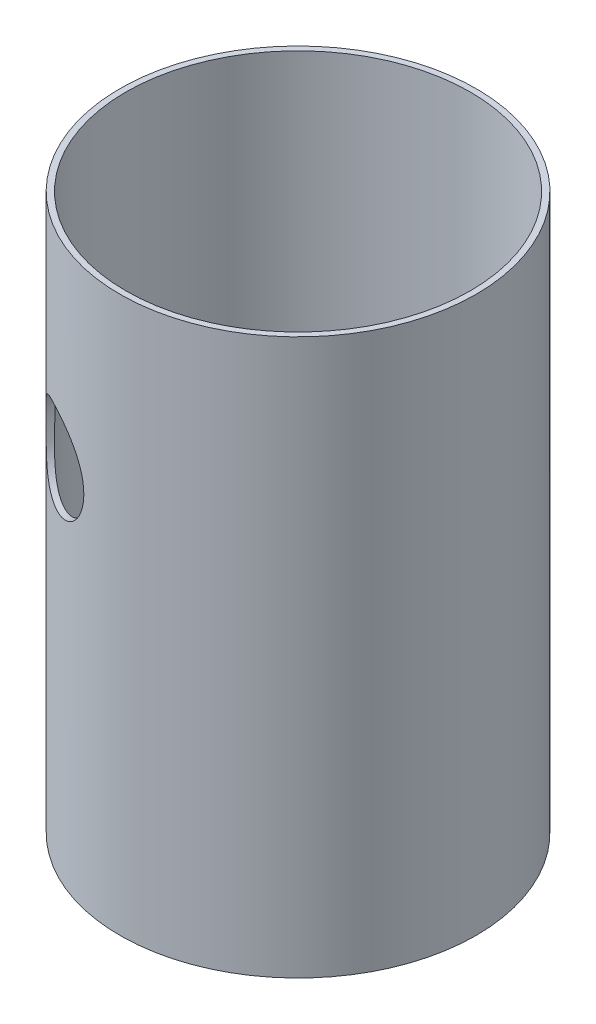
ISO-10303-21;
HEADER;
FILE_DESCRIPTION(('STEP AP214'),'2;1');
FILE_NAME('part.step','',(''),(''),'','','');
FILE_SCHEMA(('AUTOMOTIVE_DESIGN { 1 0 10303 214 1 1 1 1 }'));
ENDSEC;
DATA;
#1=APPLICATION_CONTEXT('core data for automotive mechanical design processes');
#2=APPLICATION_PROTOCOL_DEFINITION('international standard','automotive_design',2000,#1);
#3=PRODUCT_CONTEXT('',#1,'mechanical');
#4=PRODUCT('Part','Part','',(#3));
#5=PRODUCT_RELATED_PRODUCT_CATEGORY('part','',(#4));
#6=PRODUCT_DEFINITION_FORMATION('','',#4);
#7=PRODUCT_DEFINITION_CONTEXT('part definition',#1,'design');
#8=PRODUCT_DEFINITION('design','',#6,#7);
#9=PRODUCT_DEFINITION_SHAPE('','',#8);
#10=(LENGTH_UNIT() NAMED_UNIT(*) SI_UNIT(.MILLI.,.METRE.));
#11=(NAMED_UNIT(*) PLANE_ANGLE_UNIT() SI_UNIT($,.RADIAN.));
#12=(NAMED_UNIT(*) SI_UNIT($,.STERADIAN.) SOLID_ANGLE_UNIT());
#13=UNCERTAINTY_MEASURE_WITH_UNIT(LENGTH_MEASURE(1.E-05),#10,'distance_accuracy_value','');
#14=(GEOMETRIC_REPRESENTATION_CONTEXT(3) GLOBAL_UNCERTAINTY_ASSIGNED_CONTEXT((#13)) GLOBAL_UNIT_ASSIGNED_CONTEXT((#10,
#11,#12)) REPRESENTATION_CONTEXT('',''));
#15=CARTESIAN_POINT('',(0.,0.,0.));
#16=DIRECTION('',(0.,0.,1.));
#17=DIRECTION('',(1.,0.,0.));
#18=AXIS2_PLACEMENT_3D('',#15,#16,#17);
#19=CARTESIAN_POINT('',(100.573445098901,-427.,-330.861402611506));
#20=DIRECTION('',(0.,1.,0.));
#21=DIRECTION('',(0.,0.,1.));
#22=AXIS2_PLACEMENT_3D('',#19,#20,#21);
#23=CYLINDRICAL_SURFACE('',#22,211.703590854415);
#24=CARTESIAN_POINT('',(52.,0.,-124.805510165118));
#25=CARTESIAN_POINT('',(52.0000001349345,1.42356525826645,-124.805510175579));
#26=CARTESIAN_POINT('',(51.9415021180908,2.84712847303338,-124.819273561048));
#27=CARTESIAN_POINT('',(51.7079927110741,5.68412123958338,-124.87452853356));
#28=CARTESIAN_POINT('',(51.5329817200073,7.09755082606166,-124.916020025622));
#29=CARTESIAN_POINT('',(51.0678979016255,9.90419910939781,-125.027323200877));
#30=CARTESIAN_POINT('',(50.7778267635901,11.2974181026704,-125.097134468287));
#31=CARTESIAN_POINT('',(50.0850416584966,14.0537509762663,-125.266027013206));
#32=CARTESIAN_POINT('',(49.6823276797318,15.4168648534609,-125.365108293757));
#33=CARTESIAN_POINT('',(48.7676602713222,18.1032764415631,-125.59378932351));
#34=CARTESIAN_POINT('',(48.2557085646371,19.4265747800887,-125.723388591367));
#35=CARTESIAN_POINT('',(47.1269379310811,22.0240072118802,-126.014579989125));
#36=CARTESIAN_POINT('',(46.5101191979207,23.298141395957,-126.176172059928));
#37=CARTESIAN_POINT('',(45.1769982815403,25.7882364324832,-126.532941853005));
#38=CARTESIAN_POINT('',(44.4607019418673,27.0042006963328,-126.728117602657));
#39=CARTESIAN_POINT('',(42.9348866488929,29.3696504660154,-127.153685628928));
#40=CARTESIAN_POINT('',(42.1253676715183,30.5191359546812,-127.384077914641));
#41=CARTESIAN_POINT('',(40.419140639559,32.7454208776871,-127.881944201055));
#42=CARTESIAN_POINT('',(39.5223170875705,33.8221207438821,-128.149467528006));
#43=CARTESIAN_POINT('',(37.650413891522,35.8942302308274,-128.722686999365));
#44=CARTESIAN_POINT('',(36.6753344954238,36.8896401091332,-129.028383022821));
#45=CARTESIAN_POINT('',(34.655647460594,38.7931915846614,-129.678949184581));
#46=CARTESIAN_POINT('',(33.6110421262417,39.7013360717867,-130.023818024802));
#47=CARTESIAN_POINT('',(31.4614853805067,41.4255162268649,-130.753343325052));
#48=CARTESIAN_POINT('',(30.3565331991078,42.241550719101,-131.138000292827));
#49=CARTESIAN_POINT('',(28.0759814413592,43.7912442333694,-131.95433825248));
#50=CARTESIAN_POINT('',(26.8994824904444,44.523206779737,-132.386725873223));
#51=CARTESIAN_POINT('',(24.5040588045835,45.8851774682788,-133.292431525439));
#52=CARTESIAN_POINT('',(23.2851337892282,46.5151849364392,-133.765749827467));
#53=CARTESIAN_POINT('',(20.8147432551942,47.6718674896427,-134.752430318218));
#54=CARTESIAN_POINT('',(19.563273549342,48.1985292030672,-135.265797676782));
#55=CARTESIAN_POINT('',(17.0376327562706,49.1481382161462,-136.331052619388));
#56=CARTESIAN_POINT('',(15.7634609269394,49.5710821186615,-136.882941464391));
#57=CARTESIAN_POINT('',(13.1273009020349,50.3355235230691,-138.05636577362));
#58=CARTESIAN_POINT('',(11.7645036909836,50.6708786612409,-138.680084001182));
#59=CARTESIAN_POINT('',(9.03380840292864,51.2282391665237,-139.965663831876));
#60=CARTESIAN_POINT('',(7.66591016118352,51.450240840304,-140.627526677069));
#61=CARTESIAN_POINT('',(4.93374873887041,51.7837099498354,-141.986345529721));
#62=CARTESIAN_POINT('',(3.56948651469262,51.8951507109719,-142.683309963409));
#63=CARTESIAN_POINT('',(0.852943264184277,52.010778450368,-144.10866404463));
#64=CARTESIAN_POINT('',(-0.49933721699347,52.014960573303,-144.837055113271));
#65=CARTESIAN_POINT('',(-3.33337024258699,51.9144981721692,-146.403585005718));
#66=CARTESIAN_POINT('',(-4.81291260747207,51.7977738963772,-147.244955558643));
#67=CARTESIAN_POINT('',(-7.74026693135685,51.4418390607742,-148.956411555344));
#68=CARTESIAN_POINT('',(-9.18807677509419,51.2026203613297,-149.826498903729));
#69=CARTESIAN_POINT('',(-12.0457521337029,50.6066351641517,-151.590245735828));
#70=CARTESIAN_POINT('',(-13.4555947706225,50.2497994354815,-152.483918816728));
#71=CARTESIAN_POINT('',(-16.2304476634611,49.4233608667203,-154.288469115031));
#72=CARTESIAN_POINT('',(-17.5954561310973,48.953753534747,-155.199347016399));
#73=CARTESIAN_POINT('',(-20.4568599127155,47.8349812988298,-157.156274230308));
#74=CARTESIAN_POINT('',(-21.9460363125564,47.1701172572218,-158.203934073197));
#75=CARTESIAN_POINT('',(-24.8531010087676,45.7052871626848,-160.30405655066));
#76=CARTESIAN_POINT('',(-26.2709791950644,44.9053020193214,-161.356519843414));
#77=CARTESIAN_POINT('',(-29.0292650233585,43.1735432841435,-163.456046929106));
#78=CARTESIAN_POINT('',(-30.369640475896,42.241715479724,-164.503108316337));
#79=CARTESIAN_POINT('',(-32.9652563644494,40.2488345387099,-166.579369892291));
#80=CARTESIAN_POINT('',(-34.2205111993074,39.187803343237,-167.608573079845));
#81=CARTESIAN_POINT('',(-36.4623360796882,37.1010739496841,-169.487850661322));
#82=CARTESIAN_POINT('',(-37.4614349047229,36.0926710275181,-170.342211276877));
#83=CARTESIAN_POINT('',(-39.3861326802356,33.9819417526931,-172.017598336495));
#84=CARTESIAN_POINT('',(-40.3117296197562,32.8796128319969,-172.838623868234));
#85=CARTESIAN_POINT('',(-42.0810191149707,30.5824621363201,-174.434002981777));
#86=CARTESIAN_POINT('',(-42.924822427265,29.38776948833,-175.208419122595));
#87=CARTESIAN_POINT('',(-44.523095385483,26.904873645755,-176.697216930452));
#88=CARTESIAN_POINT('',(-45.277593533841,25.6167004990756,-177.411617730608));
#89=CARTESIAN_POINT('',(-46.4995554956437,23.3027765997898,-178.583833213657));
#90=CARTESIAN_POINT('',(-46.9900484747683,22.2981329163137,-179.059420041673));
#91=CARTESIAN_POINT('',(-47.9122212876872,20.2407809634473,-179.961326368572));
#92=CARTESIAN_POINT('',(-48.3439086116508,19.1880788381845,-180.387652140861));
#93=CARTESIAN_POINT('',(-49.1428198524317,17.0381240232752,-181.182519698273));
#94=CARTESIAN_POINT('',(-49.5100858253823,15.9409009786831,-181.55109916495));
#95=CARTESIAN_POINT('',(-50.1748850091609,13.7054578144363,-182.222326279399));
#96=CARTESIAN_POINT('',(-50.4724173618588,12.5672371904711,-182.524973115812));
#97=CARTESIAN_POINT('',(-50.863559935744,10.8285193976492,-182.924663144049));
#98=CARTESIAN_POINT('',(-50.9852501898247,10.2404720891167,-183.049367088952));
#99=CARTESIAN_POINT('',(-51.2087589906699,9.05679423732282,-183.278887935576));
#100=CARTESIAN_POINT('',(-51.3105800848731,8.46116467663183,-183.383707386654));
#101=CARTESIAN_POINT('',(-51.4937843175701,7.26342307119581,-183.57262017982));
#102=CARTESIAN_POINT('',(-51.5751645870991,6.66131012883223,-183.656710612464));
#103=CARTESIAN_POINT('',(-51.7169716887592,5.45209499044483,-183.803421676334));
#104=CARTESIAN_POINT('',(-51.7774013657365,4.84499348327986,-183.8660452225));
#105=CARTESIAN_POINT('',(-51.8769044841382,3.62760228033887,-183.969243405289));
#106=CARTESIAN_POINT('',(-51.9159928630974,3.01731511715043,-184.009833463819));
#107=CARTESIAN_POINT('',(-51.9726208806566,1.79474622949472,-184.068658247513));
#108=CARTESIAN_POINT('',(-51.9901633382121,1.18246477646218,-184.086895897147));
#109=CARTESIAN_POINT('',(-52.0035896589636,-0.0425798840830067,-184.100852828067));
#110=CARTESIAN_POINT('',(-51.9994743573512,-0.655343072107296,-184.096572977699));
#111=CARTESIAN_POINT('',(-51.9696244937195,-1.87970802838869,-184.06554899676));
#112=CARTESIAN_POINT('',(-51.9438907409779,-2.4913098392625,-184.038805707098));
#113=CARTESIAN_POINT('',(-51.8454483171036,-4.13853956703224,-183.936591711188));
#114=CARTESIAN_POINT('',(-51.7524792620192,-5.1717930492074,-183.840128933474));
#115=CARTESIAN_POINT('',(-51.5062637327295,-7.22304438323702,-183.585459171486));
#116=CARTESIAN_POINT('',(-51.3530259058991,-8.24104440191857,-183.427261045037));
#117=CARTESIAN_POINT('',(-50.988801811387,-10.2562607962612,-183.052864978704));
#118=CARTESIAN_POINT('',(-50.777789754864,-11.2534676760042,-182.836641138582));
#119=CARTESIAN_POINT('',(-50.3012568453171,-13.2215469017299,-182.350964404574));
#120=CARTESIAN_POINT('',(-50.0357271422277,-14.1924149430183,-182.08150286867));
#121=CARTESIAN_POINT('',(-49.3656829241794,-16.3927209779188,-181.405864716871));
#122=CARTESIAN_POINT('',(-48.9434151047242,-17.611658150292,-180.982979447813));
#123=CARTESIAN_POINT('',(-48.020228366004,-19.9922225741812,-180.067660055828));
#124=CARTESIAN_POINT('',(-47.5192887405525,-21.153834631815,-179.575207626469));
#125=CARTESIAN_POINT('',(-46.4452794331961,-23.4181288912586,-178.53127942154));
#126=CARTESIAN_POINT('',(-45.8720904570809,-24.5207092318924,-177.979706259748));
#127=CARTESIAN_POINT('',(-44.6608445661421,-26.6631522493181,-176.828581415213));
#128=CARTESIAN_POINT('',(-44.0227843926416,-27.7030117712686,-176.229027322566));
#129=CARTESIAN_POINT('',(-42.4556013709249,-30.0695164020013,-174.776155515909));
#130=CARTESIAN_POINT('',(-41.5023049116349,-31.370476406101,-173.906970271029));
#131=CARTESIAN_POINT('',(-39.4994052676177,-33.8577609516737,-172.116913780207));
#132=CARTESIAN_POINT('',(-38.4497699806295,-35.0440470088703,-171.196025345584));
#133=CARTESIAN_POINT('',(-36.2627144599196,-37.302650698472,-169.317740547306));
#134=CARTESIAN_POINT('',(-35.125245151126,-38.3749038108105,-168.360323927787));
#135=CARTESIAN_POINT('',(-32.7704892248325,-40.4043399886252,-166.42256680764));
#136=CARTESIAN_POINT('',(-31.5532096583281,-41.3615331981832,-165.442228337));
#137=CARTESIAN_POINT('',(-29.0201771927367,-43.1776040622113,-163.450080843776));
#138=CARTESIAN_POINT('',(-27.7029548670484,-44.0341682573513,-162.438032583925));
#139=CARTESIAN_POINT('',(-24.9978483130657,-45.6242130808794,-160.411654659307));
#140=CARTESIAN_POINT('',(-23.6099631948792,-46.3576921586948,-159.397324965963));
#141=CARTESIAN_POINT('',(-20.7694703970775,-47.6979609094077,-157.37553338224));
#142=CARTESIAN_POINT('',(-19.3168606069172,-48.3047464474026,-156.368071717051));
#143=CARTESIAN_POINT('',(-16.352958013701,-49.3869320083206,-154.36828370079));
#144=CARTESIAN_POINT('',(-14.8416618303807,-49.862324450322,-153.375958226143));
#145=CARTESIAN_POINT('',(-12.4587899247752,-50.493019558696,-151.855442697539));
#146=CARTESIAN_POINT('',(-11.6048439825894,-50.6961753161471,-151.319020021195));
#147=CARTESIAN_POINT('',(-9.8828190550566,-51.0598089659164,-150.254514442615));
#148=CARTESIAN_POINT('',(-9.01474143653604,-51.2202909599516,-149.726430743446));
#149=CARTESIAN_POINT('',(-7.26572161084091,-51.4975094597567,-148.67972528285));
#150=CARTESIAN_POINT('',(-6.38477656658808,-51.6142361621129,-148.161105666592));
#151=CARTESIAN_POINT('',(-4.61195049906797,-51.8027450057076,-147.134725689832));
#152=CARTESIAN_POINT('',(-3.72007088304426,-51.8745328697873,-146.626963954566));
#153=CARTESIAN_POINT('',(-1.92721565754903,-51.9720277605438,-145.623501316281));
#154=CARTESIAN_POINT('',(-1.02624143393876,-51.9977417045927,-145.127798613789));
#155=CARTESIAN_POINT('',(0.782826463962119,-52.0019734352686,-144.149592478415));
#156=CARTESIAN_POINT('',(1.69091921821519,-51.980497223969,-143.667087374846));
#157=CARTESIAN_POINT('',(3.51208407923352,-51.8892710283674,-142.716358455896));
#158=CARTESIAN_POINT('',(4.42515586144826,-51.8195241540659,-142.248133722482));
#159=CARTESIAN_POINT('',(6.25392646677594,-51.6307402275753,-141.327007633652));
#160=CARTESIAN_POINT('',(7.16962520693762,-51.5117047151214,-140.874105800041));
#161=CARTESIAN_POINT('',(8.90883321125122,-51.2379516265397,-140.029414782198));
#162=CARTESIAN_POINT('',(9.73234172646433,-51.088033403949,-139.63606374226));
#163=CARTESIAN_POINT('',(11.3774328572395,-50.7470166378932,-138.863205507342));
#164=CARTESIAN_POINT('',(12.1990153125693,-50.5559147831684,-138.4836994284));
#165=CARTESIAN_POINT('',(13.837971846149,-50.1320949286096,-137.739218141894));
#166=CARTESIAN_POINT('',(14.6553461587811,-49.8993792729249,-137.374242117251));
#167=CARTESIAN_POINT('',(16.2836419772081,-49.3920051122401,-136.65936852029));
#168=CARTESIAN_POINT('',(17.0945635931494,-49.1173473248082,-136.309470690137));
#169=CARTESIAN_POINT('',(18.706884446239,-48.5261691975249,-135.625538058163));
#170=CARTESIAN_POINT('',(19.5082912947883,-48.2096851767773,-135.291489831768));
#171=CARTESIAN_POINT('',(21.0997205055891,-47.5347108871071,-134.639393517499));
#172=CARTESIAN_POINT('',(21.8897443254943,-47.1762260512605,-134.321343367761));
#173=CARTESIAN_POINT('',(23.455920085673,-46.4174207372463,-133.701551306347));
#174=CARTESIAN_POINT('',(24.2320728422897,-46.0171027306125,-133.39980843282));
#175=CARTESIAN_POINT('',(25.7679431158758,-45.1749934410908,-132.81286552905));
#176=CARTESIAN_POINT('',(26.5276613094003,-44.7332038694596,-132.527664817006));
#177=CARTESIAN_POINT('',(27.9224740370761,-43.8737829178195,-132.01291994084));
#178=CARTESIAN_POINT('',(28.5600635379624,-43.4614981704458,-131.781190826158));
#179=CARTESIAN_POINT('',(29.8195825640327,-42.6071774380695,-131.330079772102));
#180=CARTESIAN_POINT('',(30.4415108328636,-42.1651390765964,-131.110698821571));
#181=CARTESIAN_POINT('',(31.6678741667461,-41.2520311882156,-130.684345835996));
#182=CARTESIAN_POINT('',(32.2723125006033,-40.7809671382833,-130.477371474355));
#183=CARTESIAN_POINT('',(33.4622510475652,-39.8103919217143,-130.07571490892));
#184=CARTESIAN_POINT('',(34.0477492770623,-39.3108777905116,-129.881033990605));
#185=CARTESIAN_POINT('',(35.1978835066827,-38.2844979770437,-129.503978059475));
#186=CARTESIAN_POINT('',(35.7625287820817,-37.7576447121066,-129.321597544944));
#187=CARTESIAN_POINT('',(36.869742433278,-36.6772474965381,-128.968890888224));
#188=CARTESIAN_POINT('',(37.4123082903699,-36.1237005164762,-128.798566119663));
#189=CARTESIAN_POINT('',(38.4737293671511,-34.9910608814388,-128.469840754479));
#190=CARTESIAN_POINT('',(38.9925879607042,-34.4119718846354,-128.311438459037));
#191=CARTESIAN_POINT('',(40.0052505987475,-33.2292988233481,-128.00632152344));
#192=CARTESIAN_POINT('',(40.4990522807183,-32.6257124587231,-127.859607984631));
#193=CARTESIAN_POINT('',(41.8641931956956,-30.8780278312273,-127.45913183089));
#194=CARTESIAN_POINT('',(42.7041057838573,-29.7059280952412,-127.2190096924));
#195=CARTESIAN_POINT('',(44.2862640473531,-27.2912258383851,-126.776030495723));
#196=CARTESIAN_POINT('',(45.0285159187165,-26.0486277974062,-126.573171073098));
#197=CARTESIAN_POINT('',(46.4086166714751,-23.5018594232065,-126.202925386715));
#198=CARTESIAN_POINT('',(47.0464793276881,-22.1976972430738,-126.035534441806));
#199=CARTESIAN_POINT('',(48.2120630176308,-19.5373013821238,-125.734469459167));
#200=CARTESIAN_POINT('',(48.7397839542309,-18.181067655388,-125.60079545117));
#201=CARTESIAN_POINT('',(49.6698468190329,-15.4573868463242,-125.36819401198));
#202=CARTESIAN_POINT('',(50.0747234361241,-14.0908650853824,-125.268557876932));
#203=CARTESIAN_POINT('',(50.7712345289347,-11.3274897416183,-125.098726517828));
#204=CARTESIAN_POINT('',(51.0628712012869,-9.93063674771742,-125.028530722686));
#205=CARTESIAN_POINT('',(51.5304613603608,-7.11659510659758,-124.916618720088));
#206=CARTESIAN_POINT('',(51.7064161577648,-5.69940668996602,-124.874902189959));
#207=CARTESIAN_POINT('',(51.9411856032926,-2.85481151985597,-124.819347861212));
#208=CARTESIAN_POINT('',(51.9999998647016,-1.4274047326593,-124.80551015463));
#209=CARTESIAN_POINT('',(52.,0.,-124.805510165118));
#210=B_SPLINE_CURVE_WITH_KNOTS('',3,(#24,#25,#26,#27,#28,#29,#30,#31,#32,#33,#34,#35,#36,#37,
#38,#39,#40,#41,#42,#43,#44,#45,#46,#47,#48,#49,#50,#51,#52,#53,#54,#55,#56,#57,#58,#59,#60,#61,
#62,#63,#64,#65,#66,#67,#68,#69,#70,#71,#72,#73,#74,#75,#76,#77,#78,#79,#80,#81,#82,#83,#84,#85,
#86,#87,#88,#89,#90,#91,#92,#93,#94,#95,#96,#97,#98,#99,#100,#101,#102,#103,#104,#105,#106,#107,
#108,#109,#110,#111,#112,#113,#114,#115,#116,#117,#118,#119,#120,#121,#122,#123,#124,#125,#126,
#127,#128,#129,#130,#131,#132,#133,#134,#135,#136,#137,#138,#139,#140,#141,#142,#143,#144,#145,
#146,#147,#148,#149,#150,#151,#152,#153,#154,#155,#156,#157,#158,#159,#160,#161,#162,#163,#164,
#165,#166,#167,#168,#169,#170,#171,#172,#173,#174,#175,#176,#177,#178,#179,#180,#181,#182,#183,
#184,#185,#186,#187,#188,#189,#190,#191,#192,#193,#194,#195,#196,#197,#198,#199,#200,#201,#202,
#203,#204,#205,#206,#207,#208,#209),.UNSPECIFIED.,.T.,.F.,(4,2,2,2,2,2,2,2,2,2,2,2,2,2,2,2,2,2,
2,2,2,2,2,2,2,2,2,2,2,2,2,2,2,2,2,2,2,2,2,2,2,2,2,2,2,2,2,2,2,2,2,2,2,2,2,2,2,2,2,2,2,2,2,2,2,2,
2,2,2,2,2,2,2,2,2,2,2,2,2,2,2,2,2,2,2,2,2,2,2,2,2,2,4),(0.,4.26942652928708,8.53883843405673,
12.8081876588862,17.0775373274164,21.3468196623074,25.6160941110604,29.8851178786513,
34.1541427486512,38.4288940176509,42.7036317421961,46.9782278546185,51.2528785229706,
55.6025279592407,59.9522061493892,64.3024467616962,68.6528298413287,73.2553914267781,
77.8581029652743,82.4619247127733,87.0659548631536,92.178870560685,97.2921260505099,
102.408396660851,107.524871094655,113.333767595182,119.14348548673,124.9555992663,
130.766727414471,135.73289065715,140.699189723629,145.658667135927,150.616557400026,
154.258403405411,157.899785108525,161.53878069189,165.177821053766,167.017202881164,
168.856348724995,170.69575255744,172.534906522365,174.372771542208,176.210396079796,
178.047949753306,179.88543464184,183.007063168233,186.128243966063,189.250820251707,
192.373903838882,196.440557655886,200.508283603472,204.582816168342,208.657553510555,
214.146142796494,219.63656769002,225.13008273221,230.623113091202,236.224564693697,
241.826086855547,247.427791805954,253.02981988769,256.115090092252,259.200063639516,
262.285727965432,265.370999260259,268.455807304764,271.540223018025,274.624440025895,
277.708560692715,280.482157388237,283.255977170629,286.029640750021,288.803256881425,
291.574480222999,294.345345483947,297.116047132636,299.886634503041,302.267405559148,
304.64836699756,307.028880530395,309.409642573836,311.789332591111,314.169293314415,
316.548914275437,318.928759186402,323.308367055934,327.687696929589,332.06644845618,
336.445203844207,340.726262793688,345.007238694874,349.288166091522,353.569107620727),.UNSPECIFIED.);
#211=CARTESIAN_POINT('',(52.,0.,-124.805510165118));
#212=VERTEX_POINT('',#211);
#213=EDGE_CURVE('E63',#212,#212,#210,.T.);
#214=ORIENTED_EDGE('',*,*,#213,.F.);
#215=EDGE_LOOP('',(#214));
#216=FACE_BOUND('',#215,.T.);
#217=CARTESIAN_POINT('',(100.573445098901,-427.,-330.861402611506));
#218=DIRECTION('',(0.,1.,0.));
#219=DIRECTION('',(1.,0.,0.));
#220=AXIS2_PLACEMENT_3D('',#217,#218,#219);
#221=CIRCLE('',#220,211.703590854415);
#222=CARTESIAN_POINT('',(312.277035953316,-427.,-330.861402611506));
#223=VERTEX_POINT('',#222);
#224=EDGE_CURVE('E11',#223,#223,#221,.T.);
#225=ORIENTED_EDGE('',*,*,#224,.T.);
#226=EDGE_LOOP('',(#225));
#227=FACE_BOUND('',#226,.T.);
#228=CARTESIAN_POINT('',(100.573445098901,233.,-330.861402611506));
#229=DIRECTION('',(0.,1.,0.));
#230=DIRECTION('',(1.,0.,0.));
#231=AXIS2_PLACEMENT_3D('',#228,#229,#230);
#232=CIRCLE('',#231,211.703590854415);
#233=CARTESIAN_POINT('',(312.277035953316,233.,-330.861402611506));
#234=VERTEX_POINT('',#233);
#235=EDGE_CURVE('E54',#234,#234,#232,.T.);
#236=ORIENTED_EDGE('',*,*,#235,.F.);
#237=EDGE_LOOP('',(#236));
#238=FACE_BOUND('',#237,.T.);
#239=ADVANCED_FACE('F43',(#216,#227,#238),#23,.T.);
#240=CARTESIAN_POINT('',(100.573445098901,-427.,-330.861402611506));
#241=DIRECTION('',(0.,1.,0.));
#242=DIRECTION('',(0.,0.,1.));
#243=AXIS2_PLACEMENT_3D('',#240,#241,#242);
#244=PLANE('',#243);
#245=CARTESIAN_POINT('',(100.573445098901,-427.,-330.861402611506));
#246=DIRECTION('',(0.,1.,0.));
#247=DIRECTION('',(0.,0.,1.));
#248=AXIS2_PLACEMENT_3D('',#245,#246,#247);
#249=CIRCLE('',#248,204.703590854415);
#250=CARTESIAN_POINT('',(100.573445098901,-427.,-126.157811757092));
#251=VERTEX_POINT('',#250);
#252=EDGE_CURVE('E50',#251,#251,#249,.T.);
#253=ORIENTED_EDGE('',*,*,#252,.T.);
#254=EDGE_LOOP('',(#253));
#255=FACE_BOUND('',#254,.T.);
#256=ORIENTED_EDGE('',*,*,#224,.F.);
#257=EDGE_LOOP('',(#256));
#258=FACE_BOUND('',#257,.T.);
#259=ADVANCED_FACE('F86',(#255,#258),#244,.F.);
#260=CARTESIAN_POINT('',(100.573445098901,-427.,-330.861402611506));
#261=DIRECTION('',(0.,1.,0.));
#262=DIRECTION('',(0.,0.,1.));
#263=AXIS2_PLACEMENT_3D('',#260,#261,#262);
#264=CYLINDRICAL_SURFACE('',#263,204.703590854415);
#265=CARTESIAN_POINT('',(52.,0.,-132.004216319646));
#266=CARTESIAN_POINT('',(51.9999894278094,-1.4192026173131,-132.004215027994));
#267=CARTESIAN_POINT('',(51.9418390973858,-2.83878014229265,-132.018394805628));
#268=CARTESIAN_POINT('',(51.7096528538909,-5.66817096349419,-132.075327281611));
#269=CARTESIAN_POINT('',(51.5355745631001,-7.07798049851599,-132.118090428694));
#270=CARTESIAN_POINT('',(51.0726070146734,-9.87964541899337,-132.232894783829));
#271=CARTESIAN_POINT('',(50.783545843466,-11.2714706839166,-132.304979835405));
#272=CARTESIAN_POINT('',(50.0930843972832,-14.0248822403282,-132.479397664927));
#273=CARTESIAN_POINT('',(49.691694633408,-15.386471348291,-132.581727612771));
#274=CARTESIAN_POINT('',(48.7802805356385,-18.0690230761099,-132.817848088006));
#275=CARTESIAN_POINT('',(48.2703248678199,-19.3900107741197,-132.951618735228));
#276=CARTESIAN_POINT('',(47.146026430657,-21.9829260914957,-133.252168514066));
#277=CARTESIAN_POINT('',(46.5316815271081,-23.2548527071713,-133.418948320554));
#278=CARTESIAN_POINT('',(45.2042847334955,-25.7401724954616,-133.787076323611));
#279=CARTESIAN_POINT('',(44.4912747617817,-26.9535902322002,-133.988409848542));
#280=CARTESIAN_POINT('',(42.9726925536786,-29.3141129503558,-134.427348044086));
#281=CARTESIAN_POINT('',(42.1671208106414,-30.4612182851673,-134.664952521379));
#282=CARTESIAN_POINT('',(40.4693189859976,-32.6832099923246,-135.178389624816));
#283=CARTESIAN_POINT('',(39.5769552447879,-33.7579805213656,-135.454281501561));
#284=CARTESIAN_POINT('',(37.7147178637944,-35.8264808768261,-136.045349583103));
#285=CARTESIAN_POINT('',(36.7448443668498,-36.8202108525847,-136.360525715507));
#286=CARTESIAN_POINT('',(34.7363253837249,-38.7207870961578,-137.031181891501));
#287=CARTESIAN_POINT('',(33.6976780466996,-39.6276310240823,-137.386663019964));
#288=CARTESIAN_POINT('',(31.5609114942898,-41.3496280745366,-138.138511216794));
#289=CARTESIAN_POINT('',(30.462791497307,-42.1647799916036,-138.53487882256));
#290=CARTESIAN_POINT('',(28.1957717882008,-43.7140508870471,-139.376361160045));
#291=CARTESIAN_POINT('',(27.0259354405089,-44.4463804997,-139.822245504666));
#292=CARTESIAN_POINT('',(24.6447543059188,-45.8095878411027,-140.756091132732));
#293=CARTESIAN_POINT('',(23.4334092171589,-46.440464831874,-141.244052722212));
#294=CARTESIAN_POINT('',(20.9791341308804,-47.5995585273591,-142.261110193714));
#295=CARTESIAN_POINT('',(19.7362001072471,-48.1277620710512,-142.790211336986));
#296=CARTESIAN_POINT('',(17.2285835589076,-49.0813155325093,-143.887961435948));
#297=CARTESIAN_POINT('',(15.9639002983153,-49.506661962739,-144.456611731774));
#298=CARTESIAN_POINT('',(13.3437118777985,-50.2784596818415,-145.667605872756));
#299=CARTESIAN_POINT('',(11.9874047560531,-50.6184496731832,-146.312331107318));
#300=CARTESIAN_POINT('',(9.270625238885,-51.1857553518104,-147.641200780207));
#301=CARTESIAN_POINT('',(7.9101527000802,-51.413067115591,-148.325346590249));
#302=CARTESIAN_POINT('',(5.19370909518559,-51.7580955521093,-149.729945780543));
#303=CARTESIAN_POINT('',(3.83773927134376,-51.8757841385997,-150.450408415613));
#304=CARTESIAN_POINT('',(1.13856129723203,-52.0050920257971,-151.923902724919));
#305=CARTESIAN_POINT('',(-0.204646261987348,-52.0167064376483,-152.676935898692));
#306=CARTESIAN_POINT('',(-3.02854573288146,-51.9331427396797,-154.302222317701));
#307=CARTESIAN_POINT('',(-4.50679617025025,-51.8252247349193,-155.178070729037));
#308=CARTESIAN_POINT('',(-7.43058596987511,-51.4874023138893,-156.960219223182));
#309=CARTESIAN_POINT('',(-8.87612301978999,-51.2574893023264,-157.866521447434));
#310=CARTESIAN_POINT('',(-11.7284382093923,-50.6809826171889,-159.704378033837));
#311=CARTESIAN_POINT('',(-13.1351937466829,-50.3343223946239,-160.63594651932));
#312=CARTESIAN_POINT('',(-15.903354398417,-49.5293983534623,-162.517952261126));
#313=CARTESIAN_POINT('',(-17.2647576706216,-49.0711300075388,-163.468390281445));
#314=CARTESIAN_POINT('',(-20.1341012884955,-47.9720034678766,-165.522955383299));
#315=CARTESIAN_POINT('',(-21.6341182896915,-47.3141986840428,-166.629114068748));
#316=CARTESIAN_POINT('',(-24.5616437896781,-45.8627918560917,-168.848610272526));
#317=CARTESIAN_POINT('',(-25.9891414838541,-45.069169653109,-169.961948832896));
#318=CARTESIAN_POINT('',(-28.7660993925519,-43.3495138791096,-172.185607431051));
#319=CARTESIAN_POINT('',(-30.1155170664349,-42.423409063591,-173.295925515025));
#320=CARTESIAN_POINT('',(-32.7289970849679,-40.4413424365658,-175.500724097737));
#321=CARTESIAN_POINT('',(-33.9930738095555,-39.3854025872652,-176.595207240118));
#322=CARTESIAN_POINT('',(-36.2543354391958,-37.3046077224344,-178.599575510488));
#323=CARTESIAN_POINT('',(-37.2638211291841,-36.2969451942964,-179.513455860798));
#324=CARTESIAN_POINT('',(-39.2095321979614,-34.1858628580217,-181.308633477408));
#325=CARTESIAN_POINT('',(-40.1457538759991,-33.0824382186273,-182.189929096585));
#326=CARTESIAN_POINT('',(-41.9366936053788,-30.7804760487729,-183.905775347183));
#327=CARTESIAN_POINT('',(-42.791522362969,-29.5820718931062,-184.740388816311));
#328=CARTESIAN_POINT('',(-44.4122491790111,-27.0880457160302,-186.348391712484));
#329=CARTESIAN_POINT('',(-45.1781804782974,-25.792460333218,-187.121803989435));
#330=CARTESIAN_POINT('',(-46.4018971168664,-23.4953226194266,-188.375127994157));
#331=CARTESIAN_POINT('',(-46.8845232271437,-22.5178173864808,-188.87498934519));
#332=CARTESIAN_POINT('',(-47.794896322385,-20.5148157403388,-189.826553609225));
#333=CARTESIAN_POINT('',(-48.2226478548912,-19.4893233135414,-190.278260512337));
#334=CARTESIAN_POINT('',(-49.0174921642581,-17.393669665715,-191.12433382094));
#335=CARTESIAN_POINT('',(-49.3846583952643,-16.3235645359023,-191.518769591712));
#336=CARTESIAN_POINT('',(-50.0532307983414,-14.1412708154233,-192.241752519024));
#337=CARTESIAN_POINT('',(-50.3546476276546,-13.0290890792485,-192.570310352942));
#338=CARTESIAN_POINT('',(-50.8445220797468,-10.9450805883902,-193.107019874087));
#339=CARTESIAN_POINT('',(-51.0432680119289,-9.9784458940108,-193.325960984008));
#340=CARTESIAN_POINT('',(-51.3867110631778,-8.02431463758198,-193.705517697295));
#341=CARTESIAN_POINT('',(-51.5314138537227,-7.03682027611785,-193.866139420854));
#342=CARTESIAN_POINT('',(-51.764115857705,-5.04761359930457,-194.124947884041));
#343=CARTESIAN_POINT('',(-51.8521486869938,-4.04591007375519,-194.223171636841));
#344=CARTESIAN_POINT('',(-51.9699355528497,-2.03478265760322,-194.354681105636));
#345=CARTESIAN_POINT('',(-51.9996887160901,-1.02535865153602,-194.387965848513));
#346=CARTESIAN_POINT('',(-52.0003067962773,0.994781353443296,-194.388656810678));
#347=CARTESIAN_POINT('',(-51.9710987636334,2.00549740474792,-194.355981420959));
#348=CARTESIAN_POINT('',(-51.854246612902,4.01925631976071,-194.225512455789));
#349=CARTESIAN_POINT('',(-51.7666034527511,5.02229930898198,-194.127719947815));
#350=CARTESIAN_POINT('',(-51.5345226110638,7.01420161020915,-193.869591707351));
#351=CARTESIAN_POINT('',(-51.390051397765,8.00305219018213,-193.709219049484));
#352=CARTESIAN_POINT('',(-51.0469181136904,9.95988959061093,-193.329985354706));
#353=CARTESIAN_POINT('',(-50.8482494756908,10.9278738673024,-193.111117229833));
#354=CARTESIAN_POINT('',(-50.3479767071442,13.0591050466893,-192.562985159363));
#355=CARTESIAN_POINT('',(-50.033191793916,14.215717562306,-192.219895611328));
#356=CARTESIAN_POINT('',(-49.3326681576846,16.4832380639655,-191.462755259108));
#357=CARTESIAN_POINT('',(-48.9469138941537,17.5941359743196,-191.048688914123));
#358=CARTESIAN_POINT('',(-48.1102048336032,19.7678193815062,-190.159215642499));
#359=CARTESIAN_POINT('',(-47.6591461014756,20.830524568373,-189.683711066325));
#360=CARTESIAN_POINT('',(-46.6982229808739,22.9037514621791,-188.681593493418));
#361=CARTESIAN_POINT('',(-46.1883545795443,23.9142696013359,-188.154977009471));
#362=CARTESIAN_POINT('',(-44.9054969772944,26.2664197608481,-186.845527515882));
#363=CARTESIAN_POINT('',(-44.10745912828,27.5834270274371,-186.042888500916));
#364=CARTESIAN_POINT('',(-42.4192002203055,30.1152490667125,-184.375661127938));
#365=CARTESIAN_POINT('',(-41.5289434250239,31.3300238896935,-183.511048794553));
#366=CARTESIAN_POINT('',(-39.664751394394,33.6590822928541,-181.735729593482));
#367=CARTESIAN_POINT('',(-38.690753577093,34.7732894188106,-180.824988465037));
#368=CARTESIAN_POINT('',(-36.6669201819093,36.9011202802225,-178.97155664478));
#369=CARTESIAN_POINT('',(-35.6170922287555,37.9147541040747,-178.028869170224));
#370=CARTESIAN_POINT('',(-33.4141882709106,39.87139026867,-176.093548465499));
#371=CARTESIAN_POINT('',(-32.2589430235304,40.8113062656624,-175.1002682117));
#372=CARTESIAN_POINT('',(-29.8791062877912,42.5845139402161,-173.101754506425));
#373=CARTESIAN_POINT('',(-28.6545138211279,43.4178041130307,-172.096520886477));
#374=CARTESIAN_POINT('',(-26.1404647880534,44.9762585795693,-170.082859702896));
#375=CARTESIAN_POINT('',(-24.850996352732,45.7014029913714,-169.074431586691));
#376=CARTESIAN_POINT('',(-22.2116732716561,47.0407402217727,-167.062356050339));
#377=CARTESIAN_POINT('',(-20.8618135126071,47.6549236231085,-166.058709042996));
#378=CARTESIAN_POINT('',(-18.6668021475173,48.5420254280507,-164.469263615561));
#379=CARTESIAN_POINT('',(-17.8394482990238,48.85220359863,-163.879392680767));
#380=CARTESIAN_POINT('',(-16.1663513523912,49.4310889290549,-162.705451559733));
#381=CARTESIAN_POINT('',(-15.3206096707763,49.6997992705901,-162.121380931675));
#382=CARTESIAN_POINT('',(-13.6116612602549,50.1947636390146,-160.960286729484));
#383=CARTESIAN_POINT('',(-12.7484495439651,50.4210053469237,-160.383265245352));
#384=CARTESIAN_POINT('',(-11.0062024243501,50.8297551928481,-159.237893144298));
#385=CARTESIAN_POINT('',(-10.1271689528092,51.0122686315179,-158.669541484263));
#386=CARTESIAN_POINT('',(-8.3550970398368,51.3322761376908,-157.543098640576));
#387=CARTESIAN_POINT('',(-7.4620661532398,51.4697936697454,-156.985002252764));
#388=CARTESIAN_POINT('',(-5.66328410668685,51.6986374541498,-155.880170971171));
#389=CARTESIAN_POINT('',(-4.7575344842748,51.7899692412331,-155.333434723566));
#390=CARTESIAN_POINT('',(-2.93517730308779,51.9251318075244,-154.252662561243));
#391=CARTESIAN_POINT('',(-2.0185718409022,51.9689716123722,-153.718624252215));
#392=CARTESIAN_POINT('',(-0.17647080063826,52.0078613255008,-152.664486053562));
#393=CARTESIAN_POINT('',(0.749024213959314,52.0029143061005,-152.144385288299));
#394=CARTESIAN_POINT('',(3.1275140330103,51.9261164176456,-150.831990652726));
#395=CARTESIAN_POINT('',(4.58548419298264,51.8183279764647,-150.05048762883));
#396=CARTESIAN_POINT('',(7.50818286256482,51.4761211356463,-148.528930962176));
#397=CARTESIAN_POINT('',(8.97291042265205,51.2417200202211,-147.788871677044));
#398=CARTESIAN_POINT('',(11.1660971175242,50.7924739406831,-146.713227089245));
#399=CARTESIAN_POINT('',(11.8964254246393,50.6264757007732,-146.360457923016));
#400=CARTESIAN_POINT('',(13.3544435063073,50.2615494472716,-145.666756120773));
#401=CARTESIAN_POINT('',(14.0821335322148,50.0626246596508,-145.325822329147));
#402=CARTESIAN_POINT('',(15.5333971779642,49.6315092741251,-144.656168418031));
#403=CARTESIAN_POINT('',(16.2569701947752,49.3993139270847,-144.327450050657));
#404=CARTESIAN_POINT('',(17.6981536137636,48.901497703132,-143.682693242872));
#405=CARTESIAN_POINT('',(18.4157646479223,48.6358804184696,-143.366653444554));
#406=CARTESIAN_POINT('',(19.8472619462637,48.0695527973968,-142.745865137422));
#407=CARTESIAN_POINT('',(20.5611063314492,47.7686583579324,-142.44118789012));
#408=CARTESIAN_POINT('',(21.979167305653,47.1330018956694,-141.845289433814));
#409=CARTESIAN_POINT('',(22.6833849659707,46.7982436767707,-141.554066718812));
#410=CARTESIAN_POINT('',(24.0804940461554,46.0949187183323,-140.985239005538));
#411=CARTESIAN_POINT('',(24.773383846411,45.726347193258,-140.70763594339));
#412=CARTESIAN_POINT('',(26.1457399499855,44.9557504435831,-140.166303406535));
#413=CARTESIAN_POINT('',(26.8252078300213,44.5537291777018,-139.90257229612));
#414=CARTESIAN_POINT('',(28.1687961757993,43.7166482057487,-139.389096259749));
#415=CARTESIAN_POINT('',(28.8329183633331,43.2815922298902,-139.139349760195));
#416=CARTESIAN_POINT('',(30.1438830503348,42.378999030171,-138.653896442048));
#417=CARTESIAN_POINT('',(30.7907275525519,41.9114655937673,-138.4181879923));
#418=CARTESIAN_POINT('',(32.0652802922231,40.9445678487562,-137.960780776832));
#419=CARTESIAN_POINT('',(32.6929888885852,40.4452041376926,-137.739081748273));
#420=CARTESIAN_POINT('',(33.9273778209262,39.4154666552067,-137.309629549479));
#421=CARTESIAN_POINT('',(34.534058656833,38.8850936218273,-137.101876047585));
#422=CARTESIAN_POINT('',(35.6678885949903,37.8462070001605,-136.719310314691));
#423=CARTESIAN_POINT('',(36.1971122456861,37.3404158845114,-136.543244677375));
#424=CARTESIAN_POINT('',(37.2355479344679,36.3049805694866,-136.202291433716));
#425=CARTESIAN_POINT('',(37.7447582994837,35.7753343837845,-136.037404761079));
#426=CARTESIAN_POINT('',(38.7417518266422,34.6931959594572,-135.718696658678));
#427=CARTESIAN_POINT('',(39.2295381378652,34.1407071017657,-135.564873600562));
#428=CARTESIAN_POINT('',(40.1825750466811,33.0137140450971,-135.268069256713));
#429=CARTESIAN_POINT('',(40.6478233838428,32.4392076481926,-135.125089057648));
#430=CARTESIAN_POINT('',(41.5545699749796,31.2692417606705,-134.849777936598));
#431=CARTESIAN_POINT('',(41.9960673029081,30.6737814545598,-134.717447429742));
#432=CARTESIAN_POINT('',(42.8542189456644,29.4629703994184,-134.463206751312));
#433=CARTESIAN_POINT('',(43.2708706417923,28.8476175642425,-134.341297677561));
#434=CARTESIAN_POINT('',(44.0781807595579,27.5983142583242,-134.107694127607));
#435=CARTESIAN_POINT('',(44.4688428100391,26.9643664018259,-133.995998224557));
#436=CARTESIAN_POINT('',(45.2232695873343,25.679009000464,-133.782555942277));
#437=CARTESIAN_POINT('',(45.5870317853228,25.027597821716,-133.680810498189));
#438=CARTESIAN_POINT('',(46.6038183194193,23.1107825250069,-133.399206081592));
#439=CARTESIAN_POINT('',(47.2203070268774,21.8238301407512,-133.232097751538));
#440=CARTESIAN_POINT('',(48.3465156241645,19.2003384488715,-132.931496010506));
#441=CARTESIAN_POINT('',(48.8562294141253,17.8637963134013,-132.798004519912));
#442=CARTESIAN_POINT('',(49.7637433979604,15.1528807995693,-132.563259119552));
#443=CARTESIAN_POINT('',(50.1617204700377,13.7785710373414,-132.461954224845));
#444=CARTESIAN_POINT('',(50.8432604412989,11.0003278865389,-132.290022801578));
#445=CARTESIAN_POINT('',(51.1268652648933,9.59640555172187,-132.219385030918));
#446=CARTESIAN_POINT('',(51.4598341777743,7.5069708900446,-132.136907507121));
#447=CARTESIAN_POINT('',(51.5542118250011,6.8287812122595,-132.113618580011));
#448=CARTESIAN_POINT('',(51.716119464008,5.46913225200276,-132.073754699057));
#449=CARTESIAN_POINT('',(51.7836560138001,4.78767380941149,-132.057178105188));
#450=CARTESIAN_POINT('',(51.8917665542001,3.42248790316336,-132.030677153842));
#451=CARTESIAN_POINT('',(51.9323403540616,2.73876042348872,-132.020752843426));
#452=CARTESIAN_POINT('',(51.986462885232,1.37005125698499,-132.007521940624));
#453=CARTESIAN_POINT('',(52.0000051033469,0.685069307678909,-132.004216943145));
#454=CARTESIAN_POINT('',(52.,0.,-132.004216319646));
#455=B_SPLINE_CURVE_WITH_KNOTS('',3,(#265,#266,#267,#268,#269,#270,#271,#272,#273,#274,#275,
#276,#277,#278,#279,#280,#281,#282,#283,#284,#285,#286,#287,#288,#289,#290,#291,#292,#293,#294,
#295,#296,#297,#298,#299,#300,#301,#302,#303,#304,#305,#306,#307,#308,#309,#310,#311,#312,#313,
#314,#315,#316,#317,#318,#319,#320,#321,#322,#323,#324,#325,#326,#327,#328,#329,#330,#331,#332,
#333,#334,#335,#336,#337,#338,#339,#340,#341,#342,#343,#344,#345,#346,#347,#348,#349,#350,#351,
#352,#353,#354,#355,#356,#357,#358,#359,#360,#361,#362,#363,#364,#365,#366,#367,#368,#369,#370,
#371,#372,#373,#374,#375,#376,#377,#378,#379,#380,#381,#382,#383,#384,#385,#386,#387,#388,#389,
#390,#391,#392,#393,#394,#395,#396,#397,#398,#399,#400,#401,#402,#403,#404,#405,#406,#407,#408,
#409,#410,#411,#412,#413,#414,#415,#416,#417,#418,#419,#420,#421,#422,#423,#424,#425,#426,#427,
#428,#429,#430,#431,#432,#433,#434,#435,#436,#437,#438,#439,#440,#441,#442,#443,#444,#445,#446,
#447,#448,#449,#450,#451,#452,#453,#454),.UNSPECIFIED.,.T.,.F.,(4,2,2,2,2,2,2,2,2,2,2,2,2,2,2,2,
2,2,2,2,2,2,2,2,2,2,2,2,2,2,2,2,2,2,2,2,2,2,2,2,2,2,2,2,2,2,2,2,2,2,2,2,2,2,2,2,2,2,2,2,2,2,2,2,
2,2,2,2,2,2,2,2,2,2,2,2,2,2,2,2,2,2,2,2,2,2,2,2,2,2,2,2,2,2,4),(0.,4.25699765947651,
8.51555232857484,12.7804981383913,17.0450449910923,21.3069025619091,25.5688472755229,
29.8289868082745,34.0891036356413,38.3558881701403,42.6226648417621,46.8895563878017,
51.1565040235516,55.5028223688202,59.8491723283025,64.1960790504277,68.5431331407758,
73.1575469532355,77.772121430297,82.3878778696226,87.003847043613,92.163516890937,
97.323550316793,102.486530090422,107.649719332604,113.572827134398,119.496814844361,
125.42400032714,131.350184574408,136.42794719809,141.505966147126,146.57697651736,
151.646084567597,155.241193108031,158.836003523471,162.426423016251,166.016260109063,
169.045711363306,172.074844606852,175.102179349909,178.129559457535,181.160687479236,
184.19176581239,187.224635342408,190.257872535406,193.992838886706,197.728624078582,
201.470421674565,205.212474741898,210.414414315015,215.618377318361,220.826263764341,
226.033627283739,231.39938861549,236.765225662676,242.132047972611,247.499325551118,
250.685640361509,253.871710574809,257.058703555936,260.245310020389,263.430252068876,
266.614812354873,269.798767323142,272.98252178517,277.950361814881,282.917523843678,
285.400538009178,287.883309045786,290.366434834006,292.849293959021,295.345741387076,
297.841908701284,300.338429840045,302.834655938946,305.330600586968,307.826254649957,
310.321861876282,312.817409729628,315.075485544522,317.333749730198,319.591680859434,
321.849837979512,324.108083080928,326.366565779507,328.624732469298,330.88311117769,
335.187691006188,339.492516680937,343.790488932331,348.086884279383,350.141790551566,
352.196194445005,354.250612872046,356.305526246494),.UNSPECIFIED.);
#456=CARTESIAN_POINT('',(52.,0.,-132.004216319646));
#457=VERTEX_POINT('',#456);
#458=EDGE_CURVE('E69',#457,#457,#455,.T.);
#459=ORIENTED_EDGE('',*,*,#458,.F.);
#460=EDGE_LOOP('',(#459));
#461=FACE_BOUND('',#460,.T.);
#462=ORIENTED_EDGE('',*,*,#252,.F.);
#463=EDGE_LOOP('',(#462));
#464=FACE_BOUND('',#463,.T.);
#465=CARTESIAN_POINT('',(100.573445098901,233.,-330.861402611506));
#466=DIRECTION('',(0.,1.,0.));
#467=DIRECTION('',(0.,0.,1.));
#468=AXIS2_PLACEMENT_3D('',#465,#466,#467);
#469=CIRCLE('',#468,204.703590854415);
#470=CARTESIAN_POINT('',(100.573445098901,233.,-126.157811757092));
#471=VERTEX_POINT('',#470);
#472=EDGE_CURVE('E58',#471,#471,#469,.T.);
#473=ORIENTED_EDGE('',*,*,#472,.T.);
#474=EDGE_LOOP('',(#473));
#475=FACE_BOUND('',#474,.T.);
#476=ADVANCED_FACE('F83',(#461,#464,#475),#264,.F.);
#477=CARTESIAN_POINT('',(100.573445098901,233.,-330.861402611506));
#478=DIRECTION('',(0.,1.,0.));
#479=DIRECTION('',(0.,0.,1.));
#480=AXIS2_PLACEMENT_3D('',#477,#478,#479);
#481=PLANE('',#480);
#482=ORIENTED_EDGE('',*,*,#235,.T.);
#483=EDGE_LOOP('',(#482));
#484=FACE_BOUND('',#483,.T.);
#485=ORIENTED_EDGE('',*,*,#472,.F.);
#486=EDGE_LOOP('',(#485));
#487=FACE_BOUND('',#486,.T.);
#488=ADVANCED_FACE('F77',(#484,#487),#481,.T.);
#489=CARTESIAN_POINT('',(0.,0.,-542.565993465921));
#490=DIRECTION('',(0.,0.,1.));
#491=DIRECTION('',(1.,0.,0.));
#492=AXIS2_PLACEMENT_3D('',#489,#490,#491);
#493=CYLINDRICAL_SURFACE('',#492,52.);
#494=ORIENTED_EDGE('',*,*,#213,.T.);
#495=EDGE_LOOP('',(#494));
#496=FACE_BOUND('',#495,.T.);
#497=ORIENTED_EDGE('',*,*,#458,.T.);
#498=EDGE_LOOP('',(#497));
#499=FACE_BOUND('',#498,.T.);
#500=ADVANCED_FACE('F73',(#496,#499),#493,.F.);
#501=CLOSED_SHELL('',(#239,#259,#476,#488,#500));
#502=MANIFOLD_SOLID_BREP('B2',#501);
#503=ADVANCED_BREP_SHAPE_REPRESENTATION('',(#18,#502),#14);
#504=SHAPE_DEFINITION_REPRESENTATION(#9,#503);
ENDSEC;
END-ISO-10303-21;
